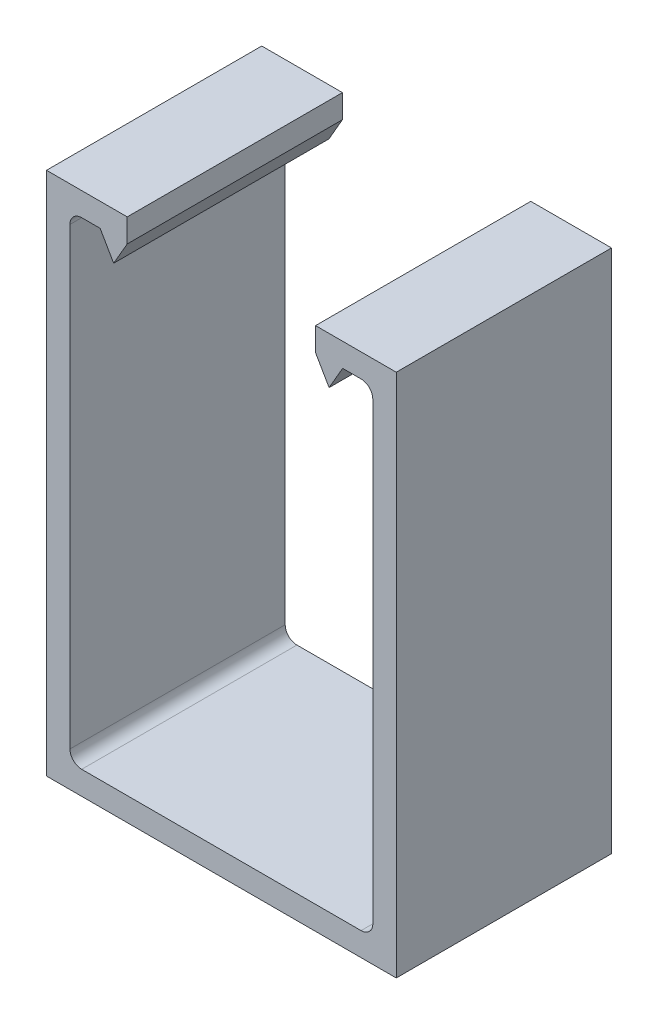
from build123d import *

# Parameters (mm, degrees)
BASE_EXTRUDE_DEPTH = 12.7


with BuildPart() as part:
    # Sketch1 → Base-Extrude (new, symmetric)
    with BuildSketch(Plane.XY):
        with BuildLine():
            Line((-11.1125, 30.95625), (-20.6375, 30.95625))
            Line((-20.6375, 30.95625), (-20.6375, -30.95625))
            Line((-20.6375, -30.95625), (20.6375, -30.95625))
            Line((20.6375, -30.95625), (20.6375, 30.95625))
            Line((20.6375, 30.95625), (11.1125, 30.95625))
            Line((11.1125, 30.95625), (11.1125, 28.18765))
            Line((11.1125, 28.18765), (12.710951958, 25.41905))
            Line((12.710951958, 25.41905), (14.309403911, 28.18765))
            Line((14.309403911, 28.18765), (16.4846, 28.18765))
            ThreePointArc((16.4846, 28.18765), (17.463447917, 27.782197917), (17.8689, 26.80335))
            Line((17.8689, 26.80335), (17.8689, -26.80335))
            ThreePointArc((17.8689, -26.80335), (17.463447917, -27.782197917), (16.4846, -28.18765))
            Line((16.4846, -28.18765), (-16.4846, -28.18765))
            ThreePointArc((-16.4846, -28.18765), (-17.463447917, -27.782197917), (-17.8689, -26.80335))
            Line((-17.8689, -26.80335), (-17.8689, 26.80335))
            ThreePointArc((-17.8689, 26.80335), (-17.463447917, 27.782197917), (-16.4846, 28.18765))
            Line((-16.4846, 28.18765), (-14.309403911, 28.18765))
            Line((-14.309403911, 28.18765), (-12.710951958, 25.41905))
            Line((-12.710951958, 25.41905), (-11.1125, 28.18765))
            Line((-11.1125, 28.18765), (-11.1125, 30.95625))
        make_face()
    extrude(amount=BASE_EXTRUDE_DEPTH, both=True)


solid = part.part
